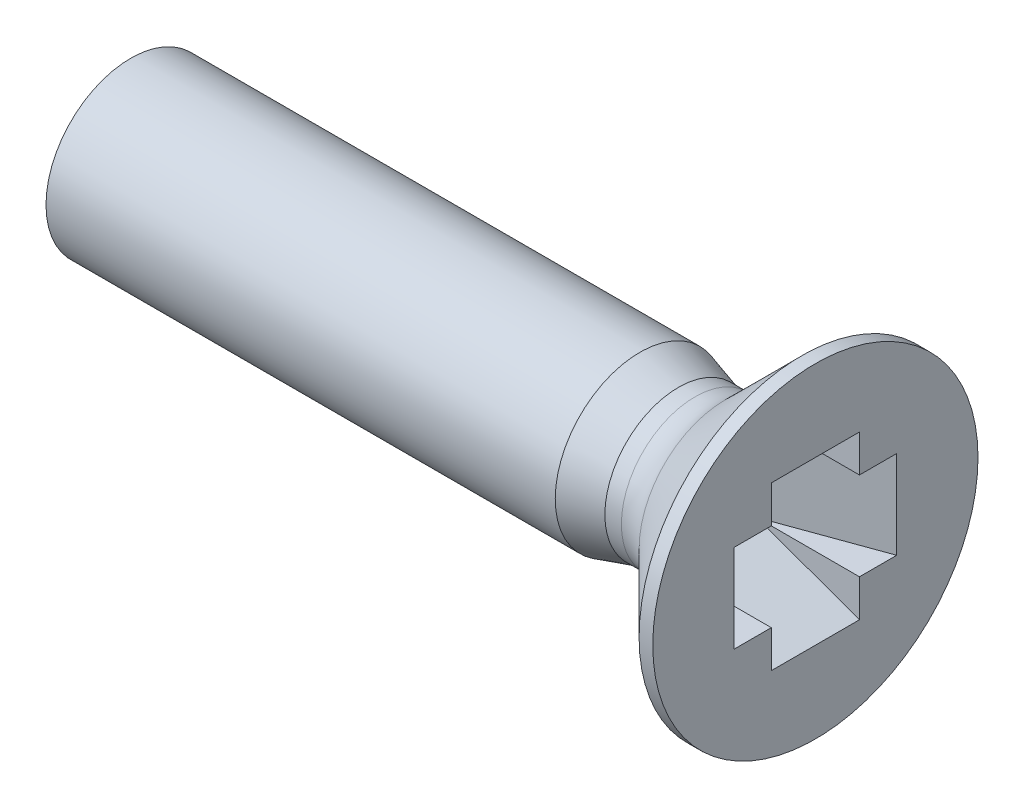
ISO-10303-21;
HEADER;
FILE_DESCRIPTION(('STEP AP214'),'2;1');
FILE_NAME('part.step','',(''),(''),'','','');
FILE_SCHEMA(('AUTOMOTIVE_DESIGN { 1 0 10303 214 1 1 1 1 }'));
ENDSEC;
DATA;
#1=APPLICATION_CONTEXT('core data for automotive mechanical design processes');
#2=APPLICATION_PROTOCOL_DEFINITION('international standard','automotive_design',2000,#1);
#3=PRODUCT_CONTEXT('',#1,'mechanical');
#4=PRODUCT('Part','Part','',(#3));
#5=PRODUCT_RELATED_PRODUCT_CATEGORY('part','',(#4));
#6=PRODUCT_DEFINITION_FORMATION('','',#4);
#7=PRODUCT_DEFINITION_CONTEXT('part definition',#1,'design');
#8=PRODUCT_DEFINITION('design','',#6,#7);
#9=PRODUCT_DEFINITION_SHAPE('','',#8);
#10=(LENGTH_UNIT() NAMED_UNIT(*) SI_UNIT(.MILLI.,.METRE.));
#11=(NAMED_UNIT(*) PLANE_ANGLE_UNIT() SI_UNIT($,.RADIAN.));
#12=(NAMED_UNIT(*) SI_UNIT($,.STERADIAN.) SOLID_ANGLE_UNIT());
#13=UNCERTAINTY_MEASURE_WITH_UNIT(LENGTH_MEASURE(1.E-05),#10,'distance_accuracy_value','');
#14=(GEOMETRIC_REPRESENTATION_CONTEXT(3) GLOBAL_UNCERTAINTY_ASSIGNED_CONTEXT((#13)) GLOBAL_UNIT_ASSIGNED_CONTEXT((#10,
#11,#12)) REPRESENTATION_CONTEXT('',''));
#15=CARTESIAN_POINT('',(0.,0.,0.));
#16=DIRECTION('',(0.,0.,1.));
#17=DIRECTION('',(1.,0.,0.));
#18=AXIS2_PLACEMENT_3D('',#15,#16,#17);
#19=CARTESIAN_POINT('',(0.,-0.949999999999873,-0.515));
#20=DIRECTION('',(0.,0.,1.));
#21=DIRECTION('',(1.,0.,0.));
#22=AXIS2_PLACEMENT_3D('',#19,#20,#21);
#23=PLANE('',#22);
#24=DIRECTION('',(0.,1.,0.));
#25=VECTOR('',#24,1.);
#26=CARTESIAN_POINT('',(0.,-0.949999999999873,-0.515));
#27=LINE('',#26,#25);
#28=CARTESIAN_POINT('',(0.,-0.949999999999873,-0.515));
#29=VERTEX_POINT('',#28);
#30=CARTESIAN_POINT('',(0.,-0.515,-0.515));
#31=VERTEX_POINT('',#30);
#32=EDGE_CURVE('E135',#29,#31,#27,.T.);
#33=ORIENTED_EDGE('',*,*,#32,.T.);
#34=DIRECTION('',(-1.,0.,0.));
#35=VECTOR('',#34,1.);
#36=CARTESIAN_POINT('',(0.,-0.515,-0.515));
#37=LINE('',#36,#35);
#38=CARTESIAN_POINT('',(-1.2,-0.515,-0.515));
#39=VERTEX_POINT('',#38);
#40=EDGE_CURVE('E271',#31,#39,#37,.T.);
#41=ORIENTED_EDGE('',*,*,#40,.T.);
#42=DIRECTION('',(0.940136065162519,-0.340799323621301,0.));
#43=VECTOR('',#42,1.);
#44=CARTESIAN_POINT('',(-1.2,-0.515,-0.515));
#45=LINE('',#44,#43);
#46=EDGE_CURVE('E157',#39,#29,#45,.T.);
#47=ORIENTED_EDGE('',*,*,#46,.T.);
#48=EDGE_LOOP('',(#33,#41,#47));
#49=FACE_BOUND('',#48,.T.);
#50=ADVANCED_FACE('F30',(#49),#23,.T.);
#51=CARTESIAN_POINT('',(0.,1.9,0.));
#52=DIRECTION('',(1.,0.,0.));
#53=DIRECTION('',(0.,0.,-1.));
#54=AXIS2_PLACEMENT_3D('',#51,#52,#53);
#55=PLANE('',#54);
#56=DIRECTION('',(0.,0.,1.));
#57=VECTOR('',#56,1.);
#58=CARTESIAN_POINT('',(0.,0.515,-0.949999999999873));
#59=LINE('',#58,#57);
#60=CARTESIAN_POINT('',(0.,0.515,-0.949999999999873));
#61=VERTEX_POINT('',#60);
#62=CARTESIAN_POINT('',(0.,0.515,-0.515));
#63=VERTEX_POINT('',#62);
#64=EDGE_CURVE('E108',#61,#63,#59,.T.);
#65=ORIENTED_EDGE('',*,*,#64,.F.);
#66=DIRECTION('',(0.,-1.,0.));
#67=VECTOR('',#66,1.);
#68=CARTESIAN_POINT('',(0.,0.515,-0.949999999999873));
#69=LINE('',#68,#67);
#70=CARTESIAN_POINT('',(0.,-0.515,-0.949999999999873));
#71=VERTEX_POINT('',#70);
#72=EDGE_CURVE('E105',#61,#71,#69,.T.);
#73=ORIENTED_EDGE('',*,*,#72,.T.);
#74=DIRECTION('',(0.,0.,1.));
#75=VECTOR('',#74,1.);
#76=CARTESIAN_POINT('',(0.,-0.515,-0.949999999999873));
#77=LINE('',#76,#75);
#78=EDGE_CURVE('E117',#71,#31,#77,.T.);
#79=ORIENTED_EDGE('',*,*,#78,.T.);
#80=ORIENTED_EDGE('',*,*,#32,.F.);
#81=DIRECTION('',(0.,0.,1.));
#82=VECTOR('',#81,1.);
#83=CARTESIAN_POINT('',(0.,-0.949999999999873,-0.515));
#84=LINE('',#83,#82);
#85=CARTESIAN_POINT('',(0.,-0.949999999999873,0.515));
#86=VERTEX_POINT('',#85);
#87=EDGE_CURVE('E141',#29,#86,#84,.T.);
#88=ORIENTED_EDGE('',*,*,#87,.T.);
#89=DIRECTION('',(0.,1.,0.));
#90=VECTOR('',#89,1.);
#91=CARTESIAN_POINT('',(0.,-0.949999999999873,0.515));
#92=LINE('',#91,#90);
#93=CARTESIAN_POINT('',(0.,-0.515,0.515));
#94=VERTEX_POINT('',#93);
#95=EDGE_CURVE('E151',#86,#94,#92,.T.);
#96=ORIENTED_EDGE('',*,*,#95,.T.);
#97=DIRECTION('',(0.,0.,1.));
#98=VECTOR('',#97,1.);
#99=CARTESIAN_POINT('',(0.,-0.515,0.515000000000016));
#100=LINE('',#99,#98);
#101=CARTESIAN_POINT('',(0.,-0.515,0.95));
#102=VERTEX_POINT('',#101);
#103=EDGE_CURVE('E45',#94,#102,#100,.T.);
#104=ORIENTED_EDGE('',*,*,#103,.T.);
#105=DIRECTION('',(0.,-1.,0.));
#106=VECTOR('',#105,1.);
#107=CARTESIAN_POINT('',(0.,0.515,0.95));
#108=LINE('',#107,#106);
#109=CARTESIAN_POINT('',(0.,0.515,0.95));
#110=VERTEX_POINT('',#109);
#111=EDGE_CURVE('E150',#110,#102,#108,.T.);
#112=ORIENTED_EDGE('',*,*,#111,.F.);
#113=DIRECTION('',(0.,0.,1.));
#114=VECTOR('',#113,1.);
#115=CARTESIAN_POINT('',(0.,0.515,0.515000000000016));
#116=LINE('',#115,#114);
#117=CARTESIAN_POINT('',(0.,0.515,0.515000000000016));
#118=VERTEX_POINT('',#117);
#119=EDGE_CURVE('E254',#118,#110,#116,.T.);
#120=ORIENTED_EDGE('',*,*,#119,.F.);
#121=CARTESIAN_POINT('',(0.,0.95,0.515));
#122=VERTEX_POINT('',#121);
#123=EDGE_CURVE('E53',#118,#122,#92,.T.);
#124=ORIENTED_EDGE('',*,*,#123,.T.);
#125=DIRECTION('',(0.,0.,1.));
#126=VECTOR('',#125,1.);
#127=CARTESIAN_POINT('',(0.,0.95,-0.515));
#128=LINE('',#127,#126);
#129=CARTESIAN_POINT('',(0.,0.95,-0.515));
#130=VERTEX_POINT('',#129);
#131=EDGE_CURVE('E131',#130,#122,#128,.T.);
#132=ORIENTED_EDGE('',*,*,#131,.F.);
#133=EDGE_CURVE('E134',#63,#130,#27,.T.);
#134=ORIENTED_EDGE('',*,*,#133,.F.);
#135=EDGE_LOOP('',(#65,#73,#79,#80,#88,#96,#104,#112,#120,#124,#132,#134));
#136=FACE_BOUND('',#135,.T.);
#137=CARTESIAN_POINT('',(0.,0.,0.));
#138=DIRECTION('',(-1.,0.,0.));
#139=DIRECTION('',(0.,0.,1.));
#140=AXIS2_PLACEMENT_3D('',#137,#138,#139);
#141=CIRCLE('',#140,1.9);
#142=CARTESIAN_POINT('',(0.,0.,1.9));
#143=VERTEX_POINT('',#142);
#144=EDGE_CURVE('E172',#143,#143,#141,.T.);
#145=ORIENTED_EDGE('',*,*,#144,.F.);
#146=EDGE_LOOP('',(#145));
#147=FACE_BOUND('',#146,.T.);
#148=ADVANCED_FACE('F190',(#136,#147),#55,.T.);
#149=CARTESIAN_POINT('',(0.,-0.949999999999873,0.515));
#150=DIRECTION('',(0.,0.,1.));
#151=DIRECTION('',(1.,0.,0.));
#152=AXIS2_PLACEMENT_3D('',#149,#150,#151);
#153=PLANE('',#152);
#154=DIRECTION('',(1.,0.,0.));
#155=VECTOR('',#154,1.);
#156=CARTESIAN_POINT('',(-1.20000000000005,0.515,0.515000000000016));
#157=LINE('',#156,#155);
#158=CARTESIAN_POINT('',(-1.20000000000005,0.515,0.515000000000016));
#159=VERTEX_POINT('',#158);
#160=EDGE_CURVE('E251',#159,#118,#157,.T.);
#161=ORIENTED_EDGE('',*,*,#160,.F.);
#162=DIRECTION('',(-0.940136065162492,-0.340799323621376,0.));
#163=VECTOR('',#162,1.);
#164=CARTESIAN_POINT('',(0.,0.95,0.515));
#165=LINE('',#164,#163);
#166=EDGE_CURVE('E127',#122,#159,#165,.T.);
#167=ORIENTED_EDGE('',*,*,#166,.F.);
#168=ORIENTED_EDGE('',*,*,#123,.F.);
#169=EDGE_LOOP('',(#161,#167,#168));
#170=FACE_BOUND('',#169,.T.);
#171=ADVANCED_FACE('F196',(#170),#153,.F.);
#172=CARTESIAN_POINT('',(0.,0.,0.));
#173=DIRECTION('',(-1.,0.,0.));
#174=DIRECTION('',(0.,0.,1.));
#175=AXIS2_PLACEMENT_3D('',#172,#173,#174);
#176=CYLINDRICAL_SURFACE('',#175,1.9);
#177=ORIENTED_EDGE('',*,*,#144,.T.);
#178=EDGE_LOOP('',(#177));
#179=FACE_BOUND('',#178,.T.);
#180=CARTESIAN_POINT('',(-0.160000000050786,0.,0.));
#181=DIRECTION('',(-1.,0.,0.));
#182=DIRECTION('',(0.,0.,1.));
#183=AXIS2_PLACEMENT_3D('',#180,#181,#182);
#184=CIRCLE('',#183,1.9);
#185=CARTESIAN_POINT('',(-0.160000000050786,0.,1.9));
#186=VERTEX_POINT('',#185);
#187=EDGE_CURVE('E158',#186,#186,#184,.T.);
#188=ORIENTED_EDGE('',*,*,#187,.F.);
#189=EDGE_LOOP('',(#188));
#190=FACE_BOUND('',#189,.T.);
#191=ADVANCED_FACE('F235',(#179,#190),#176,.T.);
#192=CARTESIAN_POINT('',(-8.,0.,0.));
#193=DIRECTION('',(-1.,0.,0.));
#194=DIRECTION('',(0.,0.,1.));
#195=AXIS2_PLACEMENT_3D('',#192,#193,#194);
#196=PLANE('',#195);
#197=CARTESIAN_POINT('',(-8.,0.,0.));
#198=DIRECTION('',(-1.,0.,0.));
#199=DIRECTION('',(0.,0.,1.));
#200=AXIS2_PLACEMENT_3D('',#197,#198,#199);
#201=CIRCLE('',#200,0.99);
#202=CARTESIAN_POINT('',(-8.,0.,0.99));
#203=VERTEX_POINT('',#202);
#204=EDGE_CURVE('E169',#203,#203,#201,.T.);
#205=ORIENTED_EDGE('',*,*,#204,.T.);
#206=EDGE_LOOP('',(#205));
#207=FACE_BOUND('',#206,.T.);
#208=ADVANCED_FACE('F232',(#207),#196,.T.);
#209=CARTESIAN_POINT('',(0.,0.,0.));
#210=DIRECTION('',(-1.,0.,0.));
#211=DIRECTION('',(0.,0.,1.));
#212=AXIS2_PLACEMENT_3D('',#209,#210,#211);
#213=CYLINDRICAL_SURFACE('',#212,0.99);
#214=CARTESIAN_POINT('',(-2.04978902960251,0.,0.));
#215=DIRECTION('',(-1.,0.,0.));
#216=DIRECTION('',(0.,0.,1.));
#217=AXIS2_PLACEMENT_3D('',#214,#215,#216);
#218=CIRCLE('',#217,0.989999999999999);
#219=CARTESIAN_POINT('',(-2.04978902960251,0.,0.989999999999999));
#220=VERTEX_POINT('',#219);
#221=EDGE_CURVE('E166',#220,#220,#218,.T.);
#222=ORIENTED_EDGE('',*,*,#221,.T.);
#223=EDGE_LOOP('',(#222));
#224=FACE_BOUND('',#223,.T.);
#225=ORIENTED_EDGE('',*,*,#204,.F.);
#226=EDGE_LOOP('',(#225));
#227=FACE_BOUND('',#226,.T.);
#228=ADVANCED_FACE('F228',(#224,#227),#213,.T.);
#229=CARTESIAN_POINT('',(-2.04978902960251,0.,0.));
#230=DIRECTION('',(-1.,0.,0.));
#231=DIRECTION('',(0.,0.,1.));
#232=AXIS2_PLACEMENT_3D('',#229,#230,#231);
#233=CONICAL_SURFACE('',#232,0.989999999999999,0.281357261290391);
#234=CARTESIAN_POINT('',(-1.60000000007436,0.,0.));
#235=DIRECTION('',(-1.,0.,0.));
#236=DIRECTION('',(0.,0.,1.));
#237=AXIS2_PLACEMENT_3D('',#234,#235,#236);
#238=CIRCLE('',#237,0.860000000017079);
#239=CARTESIAN_POINT('',(-1.60000000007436,0.,0.860000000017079));
#240=VERTEX_POINT('',#239);
#241=EDGE_CURVE('E163',#240,#240,#238,.T.);
#242=ORIENTED_EDGE('',*,*,#241,.T.);
#243=EDGE_LOOP('',(#242));
#244=FACE_BOUND('',#243,.T.);
#245=ORIENTED_EDGE('',*,*,#221,.F.);
#246=EDGE_LOOP('',(#245));
#247=FACE_BOUND('',#246,.T.);
#248=ADVANCED_FACE('F225',(#244,#247),#233,.T.);
#249=CARTESIAN_POINT('',(0.,0.,0.));
#250=DIRECTION('',(-1.,0.,0.));
#251=DIRECTION('',(0.,0.,1.));
#252=AXIS2_PLACEMENT_3D('',#249,#250,#251);
#253=CYLINDRICAL_SURFACE('',#252,0.860000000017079);
#254=CARTESIAN_POINT('',(-1.40710678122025,0.,0.));
#255=DIRECTION('',(-1.,0.,0.));
#256=DIRECTION('',(0.,0.,1.));
#257=AXIS2_PLACEMENT_3D('',#254,#255,#256);
#258=CIRCLE('',#257,0.860000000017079);
#259=CARTESIAN_POINT('',(-1.40710678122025,0.,0.860000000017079));
#260=VERTEX_POINT('',#259);
#261=EDGE_CURVE('E38',#260,#260,#258,.T.);
#262=ORIENTED_EDGE('',*,*,#261,.T.);
#263=EDGE_LOOP('',(#262));
#264=FACE_BOUND('',#263,.T.);
#265=ORIENTED_EDGE('',*,*,#241,.F.);
#266=EDGE_LOOP('',(#265));
#267=FACE_BOUND('',#266,.T.);
#268=ADVANCED_FACE('F177',(#264,#267),#253,.T.);
#269=CARTESIAN_POINT('',(-1.20000000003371,0.,0.));
#270=DIRECTION('',(1.,0.,0.));
#271=DIRECTION('',(0.,0.,-1.));
#272=AXIS2_PLACEMENT_3D('',#269,#270,#271);
#273=CONICAL_SURFACE('',#272,0.860000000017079,0.785398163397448);
#274=CARTESIAN_POINT('',(-1.05355339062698,0.,0.));
#275=DIRECTION('',(1.,0.,0.));
#276=DIRECTION('',(0.,0.,-1.));
#277=AXIS2_PLACEMENT_3D('',#274,#275,#276);
#278=CIRCLE('',#277,1.00644660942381);
#279=CARTESIAN_POINT('',(-1.05355339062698,0.,-1.00644660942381));
#280=VERTEX_POINT('',#279);
#281=EDGE_CURVE('E11',#280,#280,#278,.T.);
#282=ORIENTED_EDGE('',*,*,#281,.T.);
#283=EDGE_LOOP('',(#282));
#284=FACE_BOUND('',#283,.T.);
#285=ORIENTED_EDGE('',*,*,#187,.T.);
#286=EDGE_LOOP('',(#285));
#287=FACE_BOUND('',#286,.T.);
#288=ADVANCED_FACE('F218',(#284,#287),#273,.T.);
#289=CARTESIAN_POINT('',(-1.2,-0.515,-0.515));
#290=DIRECTION('',(-0.340799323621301,-0.940136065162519,0.));
#291=DIRECTION('',(0.940136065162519,-0.340799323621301,0.));
#292=AXIS2_PLACEMENT_3D('',#289,#290,#291);
#293=PLANE('',#292);
#294=DIRECTION('',(0.940136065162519,-0.340799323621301,0.));
#295=VECTOR('',#294,1.);
#296=CARTESIAN_POINT('',(-1.2,-0.515,0.515));
#297=LINE('',#296,#295);
#298=CARTESIAN_POINT('',(-1.20000000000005,-0.515,0.515000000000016));
#299=VERTEX_POINT('',#298);
#300=EDGE_CURVE('E147',#299,#86,#297,.T.);
#301=ORIENTED_EDGE('',*,*,#300,.T.);
#302=ORIENTED_EDGE('',*,*,#87,.F.);
#303=ORIENTED_EDGE('',*,*,#46,.F.);
#304=DIRECTION('',(0.,0.,1.));
#305=VECTOR('',#304,1.);
#306=CARTESIAN_POINT('',(-1.2,-0.515,-0.515));
#307=LINE('',#306,#305);
#308=EDGE_CURVE('E130',#39,#299,#307,.T.);
#309=ORIENTED_EDGE('',*,*,#308,.T.);
#310=EDGE_LOOP('',(#301,#302,#303,#309));
#311=FACE_BOUND('',#310,.T.);
#312=ADVANCED_FACE('F213',(#311),#293,.F.);
#313=CARTESIAN_POINT('',(-1.20000000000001,0.515000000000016,-0.515));
#314=DIRECTION('',(-1.,0.,0.));
#315=DIRECTION('',(0.,-1.,0.));
#316=AXIS2_PLACEMENT_3D('',#313,#314,#315);
#317=PLANE('',#316);
#318=DIRECTION('',(0.,-1.,0.));
#319=VECTOR('',#318,1.);
#320=CARTESIAN_POINT('',(-1.20000000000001,0.515000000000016,0.515));
#321=LINE('',#320,#319);
#322=EDGE_CURVE('E155',#159,#299,#321,.T.);
#323=ORIENTED_EDGE('',*,*,#322,.T.);
#324=ORIENTED_EDGE('',*,*,#308,.F.);
#325=DIRECTION('',(0.,-1.,0.));
#326=VECTOR('',#325,1.);
#327=CARTESIAN_POINT('',(-1.20000000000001,0.515000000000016,-0.515));
#328=LINE('',#327,#326);
#329=CARTESIAN_POINT('',(-1.20000000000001,0.515,-0.515));
#330=VERTEX_POINT('',#329);
#331=EDGE_CURVE('E102',#330,#39,#328,.T.);
#332=ORIENTED_EDGE('',*,*,#331,.F.);
#333=DIRECTION('',(0.,0.,1.));
#334=VECTOR('',#333,1.);
#335=CARTESIAN_POINT('',(-1.20000000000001,0.515000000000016,-0.515));
#336=LINE('',#335,#334);
#337=EDGE_CURVE('E123',#330,#159,#336,.T.);
#338=ORIENTED_EDGE('',*,*,#337,.T.);
#339=EDGE_LOOP('',(#323,#324,#332,#338));
#340=FACE_BOUND('',#339,.T.);
#341=ADVANCED_FACE('F138',(#340),#317,.F.);
#342=CARTESIAN_POINT('',(0.,0.95,-0.515));
#343=DIRECTION('',(-0.340799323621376,0.940136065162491,0.));
#344=DIRECTION('',(-0.940136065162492,-0.340799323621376,0.));
#345=AXIS2_PLACEMENT_3D('',#342,#343,#344);
#346=PLANE('',#345);
#347=ORIENTED_EDGE('',*,*,#166,.T.);
#348=ORIENTED_EDGE('',*,*,#337,.F.);
#349=DIRECTION('',(-0.940136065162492,-0.340799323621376,0.));
#350=VECTOR('',#349,1.);
#351=CARTESIAN_POINT('',(0.,0.95,-0.515));
#352=LINE('',#351,#350);
#353=EDGE_CURVE('E126',#130,#330,#352,.T.);
#354=ORIENTED_EDGE('',*,*,#353,.F.);
#355=ORIENTED_EDGE('',*,*,#131,.T.);
#356=EDGE_LOOP('',(#347,#348,#354,#355));
#357=FACE_BOUND('',#356,.T.);
#358=ADVANCED_FACE('F124',(#357),#346,.F.);
#359=DIRECTION('',(-1.,0.,0.));
#360=VECTOR('',#359,1.);
#361=CARTESIAN_POINT('',(0.,0.515,-0.515));
#362=LINE('',#361,#360);
#363=EDGE_CURVE('E109',#63,#330,#362,.T.);
#364=ORIENTED_EDGE('',*,*,#363,.F.);
#365=ORIENTED_EDGE('',*,*,#133,.T.);
#366=ORIENTED_EDGE('',*,*,#353,.T.);
#367=EDGE_LOOP('',(#364,#365,#366));
#368=FACE_BOUND('',#367,.T.);
#369=ADVANCED_FACE('F133',(#368),#23,.T.);
#370=ORIENTED_EDGE('',*,*,#300,.F.);
#371=DIRECTION('',(1.,0.,0.));
#372=VECTOR('',#371,1.);
#373=CARTESIAN_POINT('',(-1.20000000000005,-0.515,0.515000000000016));
#374=LINE('',#373,#372);
#375=EDGE_CURVE('E265',#299,#94,#374,.T.);
#376=ORIENTED_EDGE('',*,*,#375,.T.);
#377=ORIENTED_EDGE('',*,*,#95,.F.);
#378=EDGE_LOOP('',(#370,#376,#377));
#379=FACE_BOUND('',#378,.T.);
#380=ADVANCED_FACE('F202',(#379),#153,.F.);
#381=CARTESIAN_POINT('',(0.,0.515,0.95));
#382=DIRECTION('',(-0.340799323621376,0.,0.940136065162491));
#383=DIRECTION('',(0.940136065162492,0.,0.340799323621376));
#384=AXIS2_PLACEMENT_3D('',#381,#382,#383);
#385=PLANE('',#384);
#386=DIRECTION('',(-0.940136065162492,0.,-0.340799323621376));
#387=VECTOR('',#386,1.);
#388=CARTESIAN_POINT('',(0.,-0.515,0.95));
#389=LINE('',#388,#387);
#390=EDGE_CURVE('E255',#102,#299,#389,.T.);
#391=ORIENTED_EDGE('',*,*,#390,.T.);
#392=ORIENTED_EDGE('',*,*,#322,.F.);
#393=DIRECTION('',(-0.940136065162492,0.,-0.340799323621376));
#394=VECTOR('',#393,1.);
#395=CARTESIAN_POINT('',(0.,0.515,0.95));
#396=LINE('',#395,#394);
#397=EDGE_CURVE('E257',#110,#159,#396,.T.);
#398=ORIENTED_EDGE('',*,*,#397,.F.);
#399=ORIENTED_EDGE('',*,*,#111,.T.);
#400=EDGE_LOOP('',(#391,#392,#398,#399));
#401=FACE_BOUND('',#400,.T.);
#402=ADVANCED_FACE('F207',(#401),#385,.F.);
#403=CARTESIAN_POINT('',(0.,0.515,0.515000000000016));
#404=DIRECTION('',(0.,-1.,0.));
#405=DIRECTION('',(0.,0.,-1.));
#406=AXIS2_PLACEMENT_3D('',#403,#404,#405);
#407=PLANE('',#406);
#408=ORIENTED_EDGE('',*,*,#160,.T.);
#409=ORIENTED_EDGE('',*,*,#119,.T.);
#410=ORIENTED_EDGE('',*,*,#397,.T.);
#411=EDGE_LOOP('',(#408,#409,#410));
#412=FACE_BOUND('',#411,.T.);
#413=ADVANCED_FACE('F282',(#412),#407,.T.);
#414=CARTESIAN_POINT('',(0.,-0.515,0.515000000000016));
#415=DIRECTION('',(0.,-1.,0.));
#416=DIRECTION('',(0.,0.,-1.));
#417=AXIS2_PLACEMENT_3D('',#414,#415,#416);
#418=PLANE('',#417);
#419=ORIENTED_EDGE('',*,*,#375,.F.);
#420=ORIENTED_EDGE('',*,*,#390,.F.);
#421=ORIENTED_EDGE('',*,*,#103,.F.);
#422=EDGE_LOOP('',(#419,#420,#421));
#423=FACE_BOUND('',#422,.T.);
#424=ADVANCED_FACE('F283',(#423),#418,.F.);
#425=CARTESIAN_POINT('',(-1.20000000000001,0.515,-0.515));
#426=DIRECTION('',(-0.340799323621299,0.,-0.940136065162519));
#427=DIRECTION('',(-0.940136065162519,0.,0.340799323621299));
#428=AXIS2_PLACEMENT_3D('',#425,#426,#427);
#429=PLANE('',#428);
#430=DIRECTION('',(0.940136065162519,0.,-0.340799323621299));
#431=VECTOR('',#430,1.);
#432=CARTESIAN_POINT('',(-1.20000000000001,-0.515,-0.515));
#433=LINE('',#432,#431);
#434=EDGE_CURVE('E274',#39,#71,#433,.T.);
#435=ORIENTED_EDGE('',*,*,#434,.T.);
#436=ORIENTED_EDGE('',*,*,#72,.F.);
#437=DIRECTION('',(0.940136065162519,0.,-0.340799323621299));
#438=VECTOR('',#437,1.);
#439=CARTESIAN_POINT('',(-1.20000000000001,0.515,-0.515));
#440=LINE('',#439,#438);
#441=EDGE_CURVE('E98',#330,#61,#440,.T.);
#442=ORIENTED_EDGE('',*,*,#441,.F.);
#443=ORIENTED_EDGE('',*,*,#331,.T.);
#444=EDGE_LOOP('',(#435,#436,#442,#443));
#445=FACE_BOUND('',#444,.T.);
#446=ADVANCED_FACE('F100',(#445),#429,.F.);
#447=CARTESIAN_POINT('',(0.,0.515,-0.515));
#448=DIRECTION('',(0.,1.,0.));
#449=DIRECTION('',(0.,0.,1.));
#450=AXIS2_PLACEMENT_3D('',#447,#448,#449);
#451=PLANE('',#450);
#452=ORIENTED_EDGE('',*,*,#363,.T.);
#453=ORIENTED_EDGE('',*,*,#441,.T.);
#454=ORIENTED_EDGE('',*,*,#64,.T.);
#455=EDGE_LOOP('',(#452,#453,#454));
#456=FACE_BOUND('',#455,.T.);
#457=ADVANCED_FACE('F113',(#456),#451,.F.);
#458=CARTESIAN_POINT('',(0.,-0.515,-0.515));
#459=DIRECTION('',(0.,1.,0.));
#460=DIRECTION('',(0.,0.,1.));
#461=AXIS2_PLACEMENT_3D('',#458,#459,#460);
#462=PLANE('',#461);
#463=ORIENTED_EDGE('',*,*,#40,.F.);
#464=ORIENTED_EDGE('',*,*,#78,.F.);
#465=ORIENTED_EDGE('',*,*,#434,.F.);
#466=EDGE_LOOP('',(#463,#464,#465));
#467=FACE_BOUND('',#466,.T.);
#468=ADVANCED_FACE('F181',(#467),#462,.T.);
#469=CARTESIAN_POINT('',(-1.40710678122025,0.,0.));
#470=DIRECTION('',(-1.,0.,0.));
#471=DIRECTION('',(0.,0.,1.));
#472=AXIS2_PLACEMENT_3D('',#469,#470,#471);
#473=TOROIDAL_SURFACE('',#472,1.36000000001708,0.5);
#474=ORIENTED_EDGE('',*,*,#281,.F.);
#475=EDGE_LOOP('',(#474));
#476=FACE_BOUND('',#475,.T.);
#477=ORIENTED_EDGE('',*,*,#261,.F.);
#478=EDGE_LOOP('',(#477));
#479=FACE_BOUND('',#478,.T.);
#480=ADVANCED_FACE('F32',(#476,#479),#473,.F.);
#481=CLOSED_SHELL('',(#50,#148,#171,#191,#208,#228,#248,#268,#288,#312,#341,#358,#369,#380,#402,
#413,#424,#446,#457,#468,#480));
#482=MANIFOLD_SOLID_BREP('B2',#481);
#483=ADVANCED_BREP_SHAPE_REPRESENTATION('',(#18,#482),#14);
#484=SHAPE_DEFINITION_REPRESENTATION(#9,#483);
ENDSEC;
END-ISO-10303-21;
